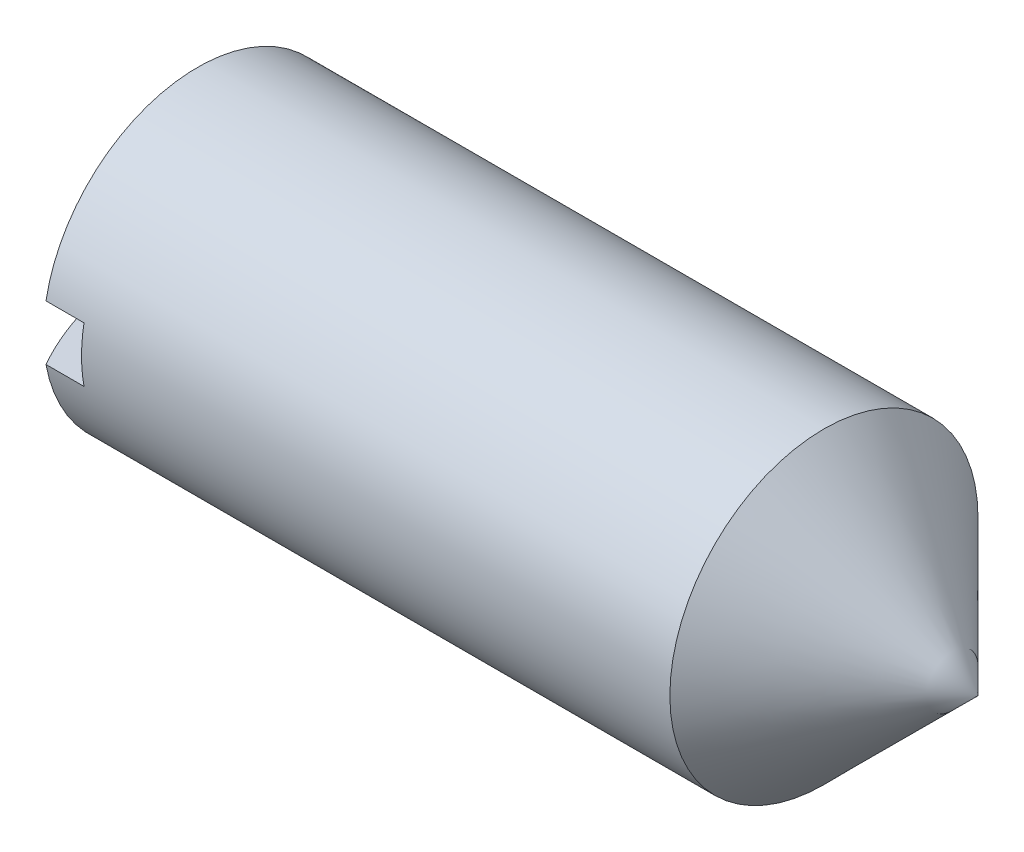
ISO-10303-21;
HEADER;
FILE_DESCRIPTION(('STEP AP214'),'2;1');
FILE_NAME('part.step','',(''),(''),'','','');
FILE_SCHEMA(('AUTOMOTIVE_DESIGN { 1 0 10303 214 1 1 1 1 }'));
ENDSEC;
DATA;
#1=APPLICATION_CONTEXT('core data for automotive mechanical design processes');
#2=APPLICATION_PROTOCOL_DEFINITION('international standard','automotive_design',2000,#1);
#3=PRODUCT_CONTEXT('',#1,'mechanical');
#4=PRODUCT('Part','Part','',(#3));
#5=PRODUCT_RELATED_PRODUCT_CATEGORY('part','',(#4));
#6=PRODUCT_DEFINITION_FORMATION('','',#4);
#7=PRODUCT_DEFINITION_CONTEXT('part definition',#1,'design');
#8=PRODUCT_DEFINITION('design','',#6,#7);
#9=PRODUCT_DEFINITION_SHAPE('','',#8);
#10=(LENGTH_UNIT() NAMED_UNIT(*) SI_UNIT(.MILLI.,.METRE.));
#11=(NAMED_UNIT(*) PLANE_ANGLE_UNIT() SI_UNIT($,.RADIAN.));
#12=(NAMED_UNIT(*) SI_UNIT($,.STERADIAN.) SOLID_ANGLE_UNIT());
#13=UNCERTAINTY_MEASURE_WITH_UNIT(LENGTH_MEASURE(1.E-05),#10,'distance_accuracy_value','');
#14=(GEOMETRIC_REPRESENTATION_CONTEXT(3) GLOBAL_UNCERTAINTY_ASSIGNED_CONTEXT((#13)) GLOBAL_UNIT_ASSIGNED_CONTEXT((#10,
#11,#12)) REPRESENTATION_CONTEXT('',''));
#15=CARTESIAN_POINT('',(0.,0.,0.));
#16=DIRECTION('',(0.,0.,1.));
#17=DIRECTION('',(1.,0.,0.));
#18=AXIS2_PLACEMENT_3D('',#15,#16,#17);
#19=CARTESIAN_POINT('',(19.05,0.,0.));
#20=DIRECTION('',(-1.,0.,0.));
#21=DIRECTION('',(0.,1.,0.));
#22=AXIS2_PLACEMENT_3D('',#19,#20,#21);
#23=SPHERICAL_SURFACE('',#22,19.05);
#24=CARTESIAN_POINT('',(19.05,1.7018,0.));
#25=DIRECTION('',(0.,-1.,0.));
#26=DIRECTION('',(0.,0.,-1.));
#27=AXIS2_PLACEMENT_3D('',#24,#25,#26);
#28=CIRCLE('',#27,18.9738340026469);
#29=CARTESIAN_POINT('',(2.55221605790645,1.7018,9.37173952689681));
#30=VERTEX_POINT('',#29);
#31=CARTESIAN_POINT('',(2.55221605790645,1.7018,-9.37173952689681));
#32=VERTEX_POINT('',#31);
#33=EDGE_CURVE('E104',#30,#32,#28,.T.);
#34=ORIENTED_EDGE('',*,*,#33,.F.);
#35=CARTESIAN_POINT('',(2.55221605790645,0.,0.));
#36=DIRECTION('',(-1.,0.,0.));
#37=DIRECTION('',(0.,0.,1.));
#38=AXIS2_PLACEMENT_3D('',#35,#36,#37);
#39=CIRCLE('',#38,9.525);
#40=EDGE_CURVE('E96',#30,#32,#39,.T.);
#41=ORIENTED_EDGE('',*,*,#40,.T.);
#42=EDGE_LOOP('',(#34,#41));
#43=FACE_BOUND('',#42,.T.);
#44=ADVANCED_FACE('F39',(#43),#23,.T.);
#45=CARTESIAN_POINT('',(19.05,-1.7018,0.));
#46=DIRECTION('',(0.,1.,0.));
#47=DIRECTION('',(0.,0.,1.));
#48=AXIS2_PLACEMENT_3D('',#45,#46,#47);
#49=CIRCLE('',#48,18.9738340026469);
#50=CARTESIAN_POINT('',(2.55221605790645,-1.7018,-9.37173952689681));
#51=VERTEX_POINT('',#50);
#52=CARTESIAN_POINT('',(2.55221605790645,-1.7018,9.37173952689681));
#53=VERTEX_POINT('',#52);
#54=EDGE_CURVE('E116',#51,#53,#49,.T.);
#55=ORIENTED_EDGE('',*,*,#54,.F.);
#56=EDGE_CURVE('E99',#51,#53,#39,.T.);
#57=ORIENTED_EDGE('',*,*,#56,.T.);
#58=EDGE_LOOP('',(#55,#57));
#59=FACE_BOUND('',#58,.T.);
#60=ADVANCED_FACE('F115',(#59),#23,.T.);
#61=CARTESIAN_POINT('',(-12.7,0.,0.));
#62=DIRECTION('',(-1.,0.,0.));
#63=DIRECTION('',(0.,0.,1.));
#64=AXIS2_PLACEMENT_3D('',#61,#62,#63);
#65=CYLINDRICAL_SURFACE('',#64,9.525);
#66=CARTESIAN_POINT('',(41.275,0.,0.));
#67=DIRECTION('',(-1.,0.,0.));
#68=DIRECTION('',(0.,0.,1.));
#69=AXIS2_PLACEMENT_3D('',#66,#67,#68);
#70=CIRCLE('',#69,9.525);
#71=CARTESIAN_POINT('',(41.275,0.,9.525));
#72=VERTEX_POINT('',#71);
#73=EDGE_CURVE('E98',#72,#72,#70,.T.);
#74=ORIENTED_EDGE('',*,*,#73,.T.);
#75=EDGE_LOOP('',(#74));
#76=FACE_BOUND('',#75,.T.);
#77=ORIENTED_EDGE('',*,*,#40,.F.);
#78=DIRECTION('',(-1.,0.,0.));
#79=VECTOR('',#78,1.);
#80=CARTESIAN_POINT('',(-12.7,1.7018,9.37173952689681));
#81=LINE('',#80,#79);
#82=CARTESIAN_POINT('',(4.9022,1.7018,9.37173952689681));
#83=VERTEX_POINT('',#82);
#84=EDGE_CURVE('E11',#30,#83,#81,.F.);
#85=ORIENTED_EDGE('',*,*,#84,.T.);
#86=CARTESIAN_POINT('',(4.9022,0.,0.));
#87=DIRECTION('',(1.,0.,0.));
#88=DIRECTION('',(0.,0.,-1.));
#89=AXIS2_PLACEMENT_3D('',#86,#87,#88);
#90=CIRCLE('',#89,9.525);
#91=CARTESIAN_POINT('',(4.9022,-1.7018,9.37173952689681));
#92=VERTEX_POINT('',#91);
#93=EDGE_CURVE('E77',#92,#83,#90,.F.);
#94=ORIENTED_EDGE('',*,*,#93,.F.);
#95=DIRECTION('',(-1.,0.,0.));
#96=VECTOR('',#95,1.);
#97=CARTESIAN_POINT('',(-12.7,-1.7018,9.37173952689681));
#98=LINE('',#97,#96);
#99=EDGE_CURVE('E46',#92,#53,#98,.T.);
#100=ORIENTED_EDGE('',*,*,#99,.T.);
#101=ORIENTED_EDGE('',*,*,#56,.F.);
#102=DIRECTION('',(-1.,0.,0.));
#103=VECTOR('',#102,1.);
#104=CARTESIAN_POINT('',(-12.7,-1.7018,-9.37173952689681));
#105=LINE('',#104,#103);
#106=CARTESIAN_POINT('',(4.9022,-1.7018,-9.37173952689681));
#107=VERTEX_POINT('',#106);
#108=EDGE_CURVE('E108',#51,#107,#105,.F.);
#109=ORIENTED_EDGE('',*,*,#108,.T.);
#110=CARTESIAN_POINT('',(4.9022,1.7018,-9.37173952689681));
#111=VERTEX_POINT('',#110);
#112=EDGE_CURVE('E86',#111,#107,#90,.F.);
#113=ORIENTED_EDGE('',*,*,#112,.F.);
#114=DIRECTION('',(-1.,0.,0.));
#115=VECTOR('',#114,1.);
#116=CARTESIAN_POINT('',(-12.7,1.7018,-9.37173952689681));
#117=LINE('',#116,#115);
#118=EDGE_CURVE('E84',#111,#32,#117,.T.);
#119=ORIENTED_EDGE('',*,*,#118,.T.);
#120=EDGE_LOOP('',(#77,#85,#94,#100,#101,#109,#113,#119));
#121=FACE_BOUND('',#120,.T.);
#122=ADVANCED_FACE('F94',(#76,#121),#65,.T.);
#123=CARTESIAN_POINT('',(41.275,0.,0.));
#124=DIRECTION('',(-1.,0.,0.));
#125=DIRECTION('',(0.,0.,1.));
#126=AXIS2_PLACEMENT_3D('',#123,#124,#125);
#127=CONICAL_SURFACE('',#126,9.525,0.78539816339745);
#128=CARTESIAN_POINT('',(50.8,0.,0.));
#129=VERTEX_POINT('',#128);
#130=VERTEX_LOOP('',#129);
#131=FACE_BOUND('',#130,.T.);
#132=ORIENTED_EDGE('',*,*,#73,.F.);
#133=EDGE_LOOP('',(#132));
#134=FACE_BOUND('',#133,.T.);
#135=ADVANCED_FACE('F126',(#131,#134),#127,.T.);
#136=CARTESIAN_POINT('',(4.9022,1.7018,-9.525));
#137=DIRECTION('',(0.,-1.,0.));
#138=DIRECTION('',(0.,0.,-1.));
#139=AXIS2_PLACEMENT_3D('',#136,#137,#138);
#140=PLANE('',#139);
#141=ORIENTED_EDGE('',*,*,#33,.T.);
#142=ORIENTED_EDGE('',*,*,#118,.F.);
#143=DIRECTION('',(0.,0.,1.));
#144=VECTOR('',#143,1.);
#145=CARTESIAN_POINT('',(4.9022,1.7018,-9.525));
#146=LINE('',#145,#144);
#147=EDGE_CURVE('E53',#111,#83,#146,.T.);
#148=ORIENTED_EDGE('',*,*,#147,.T.);
#149=ORIENTED_EDGE('',*,*,#84,.F.);
#150=EDGE_LOOP('',(#141,#142,#148,#149));
#151=FACE_BOUND('',#150,.T.);
#152=ADVANCED_FACE('F88',(#151),#140,.T.);
#153=CARTESIAN_POINT('',(4.9022,-1.7018,-9.525));
#154=DIRECTION('',(0.,1.,0.));
#155=DIRECTION('',(0.,0.,1.));
#156=AXIS2_PLACEMENT_3D('',#153,#154,#155);
#157=PLANE('',#156);
#158=ORIENTED_EDGE('',*,*,#54,.T.);
#159=ORIENTED_EDGE('',*,*,#99,.F.);
#160=DIRECTION('',(0.,0.,-1.));
#161=VECTOR('',#160,1.);
#162=CARTESIAN_POINT('',(4.9022,-1.7018,-9.525));
#163=LINE('',#162,#161);
#164=EDGE_CURVE('E80',#92,#107,#163,.T.);
#165=ORIENTED_EDGE('',*,*,#164,.T.);
#166=ORIENTED_EDGE('',*,*,#108,.F.);
#167=EDGE_LOOP('',(#158,#159,#165,#166));
#168=FACE_BOUND('',#167,.T.);
#169=ADVANCED_FACE('F118',(#168),#157,.T.);
#170=CARTESIAN_POINT('',(4.9022,1.7018,-9.525));
#171=DIRECTION('',(1.,0.,0.));
#172=DIRECTION('',(0.,0.,-1.));
#173=AXIS2_PLACEMENT_3D('',#170,#171,#172);
#174=PLANE('',#173);
#175=ORIENTED_EDGE('',*,*,#164,.F.);
#176=ORIENTED_EDGE('',*,*,#93,.T.);
#177=ORIENTED_EDGE('',*,*,#147,.F.);
#178=ORIENTED_EDGE('',*,*,#112,.T.);
#179=EDGE_LOOP('',(#175,#176,#177,#178));
#180=FACE_BOUND('',#179,.T.);
#181=ADVANCED_FACE('F78',(#180),#174,.F.);
#182=CLOSED_SHELL('',(#44,#60,#122,#135,#152,#169,#181));
#183=MANIFOLD_SOLID_BREP('B2',#182);
#184=ADVANCED_BREP_SHAPE_REPRESENTATION('',(#18,#183),#14);
#185=SHAPE_DEFINITION_REPRESENTATION(#9,#184);
ENDSEC;
END-ISO-10303-21;
